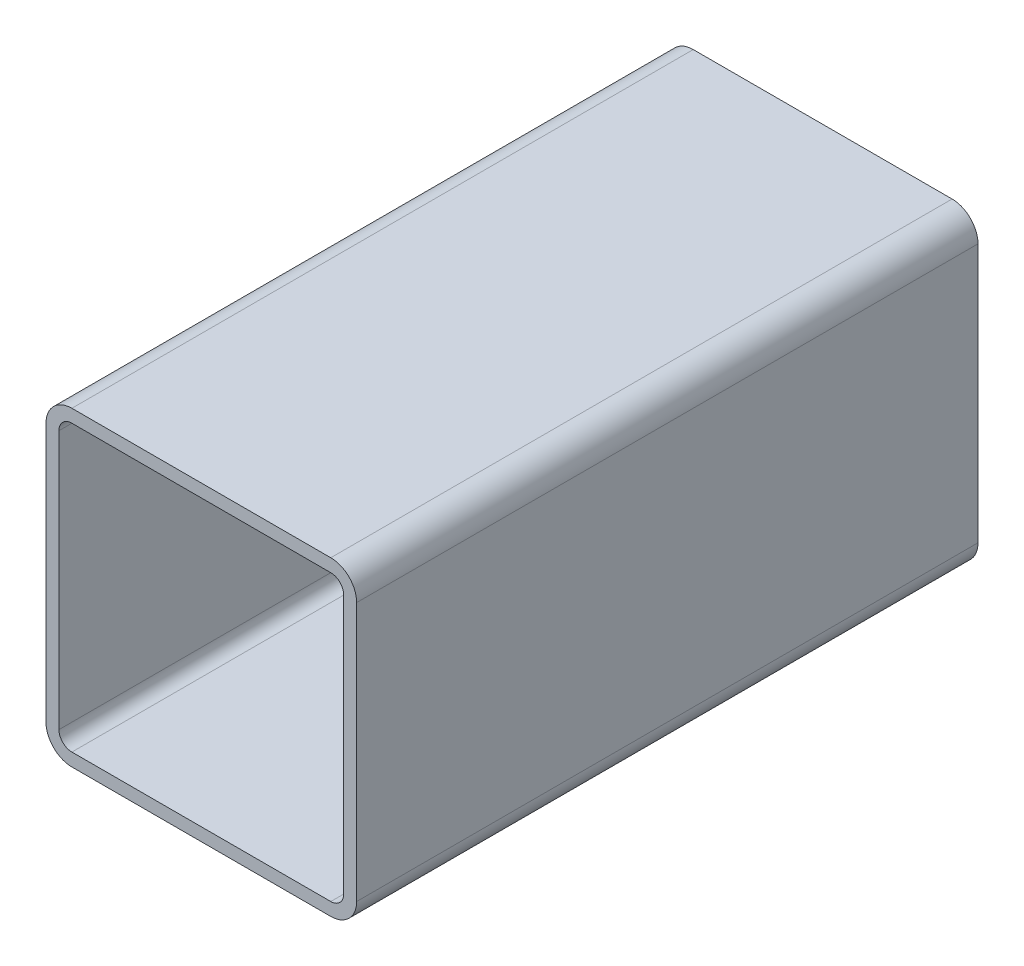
ISO-10303-21;
HEADER;
FILE_DESCRIPTION(('STEP AP214'),'2;1');
FILE_NAME('part.step','',(''),(''),'','','');
FILE_SCHEMA(('AUTOMOTIVE_DESIGN { 1 0 10303 214 1 1 1 1 }'));
ENDSEC;
DATA;
#1=APPLICATION_CONTEXT('core data for automotive mechanical design processes');
#2=APPLICATION_PROTOCOL_DEFINITION('international standard','automotive_design',2000,#1);
#3=PRODUCT_CONTEXT('',#1,'mechanical');
#4=PRODUCT('Part','Part','',(#3));
#5=PRODUCT_RELATED_PRODUCT_CATEGORY('part','',(#4));
#6=PRODUCT_DEFINITION_FORMATION('','',#4);
#7=PRODUCT_DEFINITION_CONTEXT('part definition',#1,'design');
#8=PRODUCT_DEFINITION('design','',#6,#7);
#9=PRODUCT_DEFINITION_SHAPE('','',#8);
#10=(LENGTH_UNIT() NAMED_UNIT(*) SI_UNIT(.MILLI.,.METRE.));
#11=(NAMED_UNIT(*) PLANE_ANGLE_UNIT() SI_UNIT($,.RADIAN.));
#12=(NAMED_UNIT(*) SI_UNIT($,.STERADIAN.) SOLID_ANGLE_UNIT());
#13=UNCERTAINTY_MEASURE_WITH_UNIT(LENGTH_MEASURE(1.E-05),#10,'distance_accuracy_value','');
#14=(GEOMETRIC_REPRESENTATION_CONTEXT(3) GLOBAL_UNCERTAINTY_ASSIGNED_CONTEXT((#13)) GLOBAL_UNIT_ASSIGNED_CONTEXT((#10,
#11,#12)) REPRESENTATION_CONTEXT('',''));
#15=CARTESIAN_POINT('',(0.,0.,0.));
#16=DIRECTION('',(0.,0.,1.));
#17=DIRECTION('',(1.,0.,0.));
#18=AXIS2_PLACEMENT_3D('',#15,#16,#17);
#19=CARTESIAN_POINT('',(12.7473013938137,141.711948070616,304.8));
#20=DIRECTION('',(0.,0.,1.));
#21=DIRECTION('',(1.,0.,0.));
#22=AXIS2_PLACEMENT_3D('',#19,#20,#21);
#23=PLANE('',#22);
#24=CARTESIAN_POINT('',(12.7473013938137,141.711948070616,304.8));
#25=DIRECTION('',(0.,0.,1.));
#26=DIRECTION('',(1.,0.,0.));
#27=AXIS2_PLACEMENT_3D('',#24,#25,#26);
#28=CIRCLE('',#27,12.7);
#29=CARTESIAN_POINT('',(12.7473013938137,154.411948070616,304.8));
#30=VERTEX_POINT('',#29);
#31=CARTESIAN_POINT('',(0.0473013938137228,141.711948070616,304.8));
#32=VERTEX_POINT('',#31);
#33=EDGE_CURVE('E211',#30,#32,#28,.T.);
#34=ORIENTED_EDGE('',*,*,#33,.T.);
#35=DIRECTION('',(0.,-1.,0.));
#36=VECTOR('',#35,1.);
#37=CARTESIAN_POINT('',(0.0473013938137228,14.7119480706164,304.8));
#38=LINE('',#37,#36);
#39=CARTESIAN_POINT('',(0.0473013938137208,14.7119480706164,304.8));
#40=VERTEX_POINT('',#39);
#41=EDGE_CURVE('E214',#32,#40,#38,.T.);
#42=ORIENTED_EDGE('',*,*,#41,.T.);
#43=CARTESIAN_POINT('',(12.7473013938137,14.7119480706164,304.8));
#44=DIRECTION('',(0.,0.,1.));
#45=DIRECTION('',(1.,0.,0.));
#46=AXIS2_PLACEMENT_3D('',#43,#44,#45);
#47=CIRCLE('',#46,12.7);
#48=CARTESIAN_POINT('',(12.7473013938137,2.01194807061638,304.8));
#49=VERTEX_POINT('',#48);
#50=EDGE_CURVE('E217',#40,#49,#47,.T.);
#51=ORIENTED_EDGE('',*,*,#50,.T.);
#52=DIRECTION('',(1.,0.,0.));
#53=VECTOR('',#52,1.);
#54=CARTESIAN_POINT('',(139.747301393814,2.01194807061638,304.8));
#55=LINE('',#54,#53);
#56=CARTESIAN_POINT('',(139.747301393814,2.01194807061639,304.8));
#57=VERTEX_POINT('',#56);
#58=EDGE_CURVE('E219',#49,#57,#55,.T.);
#59=ORIENTED_EDGE('',*,*,#58,.T.);
#60=CARTESIAN_POINT('',(139.747301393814,14.7119480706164,304.8));
#61=DIRECTION('',(0.,0.,1.));
#62=DIRECTION('',(1.,0.,0.));
#63=AXIS2_PLACEMENT_3D('',#60,#61,#62);
#64=CIRCLE('',#63,12.7);
#65=CARTESIAN_POINT('',(152.447301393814,14.7119480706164,304.8));
#66=VERTEX_POINT('',#65);
#67=EDGE_CURVE('E221',#57,#66,#64,.T.);
#68=ORIENTED_EDGE('',*,*,#67,.T.);
#69=DIRECTION('',(0.,1.,0.));
#70=VECTOR('',#69,1.);
#71=CARTESIAN_POINT('',(152.447301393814,141.711948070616,304.8));
#72=LINE('',#71,#70);
#73=CARTESIAN_POINT('',(152.447301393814,141.711948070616,304.8));
#74=VERTEX_POINT('',#73);
#75=EDGE_CURVE('E223',#66,#74,#72,.T.);
#76=ORIENTED_EDGE('',*,*,#75,.T.);
#77=CARTESIAN_POINT('',(139.747301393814,141.711948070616,304.8));
#78=DIRECTION('',(0.,0.,1.));
#79=DIRECTION('',(1.,0.,0.));
#80=AXIS2_PLACEMENT_3D('',#77,#78,#79);
#81=CIRCLE('',#80,12.7);
#82=CARTESIAN_POINT('',(139.747301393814,154.411948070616,304.8));
#83=VERTEX_POINT('',#82);
#84=EDGE_CURVE('E225',#74,#83,#81,.T.);
#85=ORIENTED_EDGE('',*,*,#84,.T.);
#86=DIRECTION('',(-1.,0.,0.));
#87=VECTOR('',#86,1.);
#88=CARTESIAN_POINT('',(12.7473013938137,154.411948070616,304.8));
#89=LINE('',#88,#87);
#90=EDGE_CURVE('E227',#83,#30,#89,.T.);
#91=ORIENTED_EDGE('',*,*,#90,.T.);
#92=EDGE_LOOP('',(#34,#42,#51,#59,#68,#76,#85,#91));
#93=FACE_BOUND('',#92,.T.);
#94=DIRECTION('',(0.,-1.,0.));
#95=VECTOR('',#94,1.);
#96=CARTESIAN_POINT('',(6.39730139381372,14.7119480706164,304.8));
#97=LINE('',#96,#95);
#98=CARTESIAN_POINT('',(6.39730139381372,141.711948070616,304.8));
#99=VERTEX_POINT('',#98);
#100=CARTESIAN_POINT('',(6.39730139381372,14.7119480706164,304.8));
#101=VERTEX_POINT('',#100);
#102=EDGE_CURVE('E154',#99,#101,#97,.T.);
#103=ORIENTED_EDGE('',*,*,#102,.F.);
#104=CARTESIAN_POINT('',(12.7473013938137,141.711948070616,304.8));
#105=DIRECTION('',(0.,0.,1.));
#106=DIRECTION('',(1.,0.,0.));
#107=AXIS2_PLACEMENT_3D('',#104,#105,#106);
#108=CIRCLE('',#107,6.35);
#109=CARTESIAN_POINT('',(12.7473013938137,148.061948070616,304.8));
#110=VERTEX_POINT('',#109);
#111=EDGE_CURVE('E146',#110,#99,#108,.T.);
#112=ORIENTED_EDGE('',*,*,#111,.F.);
#113=DIRECTION('',(-1.,0.,0.));
#114=VECTOR('',#113,1.);
#115=CARTESIAN_POINT('',(12.7473013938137,148.061948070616,304.8));
#116=LINE('',#115,#114);
#117=CARTESIAN_POINT('',(139.747301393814,148.061948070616,304.8));
#118=VERTEX_POINT('',#117);
#119=EDGE_CURVE('E179',#118,#110,#116,.T.);
#120=ORIENTED_EDGE('',*,*,#119,.F.);
#121=CARTESIAN_POINT('',(139.747301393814,141.711948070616,304.8));
#122=DIRECTION('',(0.,0.,1.));
#123=DIRECTION('',(1.,0.,0.));
#124=AXIS2_PLACEMENT_3D('',#121,#122,#123);
#125=CIRCLE('',#124,6.34999999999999);
#126=CARTESIAN_POINT('',(146.097301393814,141.711948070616,304.8));
#127=VERTEX_POINT('',#126);
#128=EDGE_CURVE('E177',#127,#118,#125,.T.);
#129=ORIENTED_EDGE('',*,*,#128,.F.);
#130=DIRECTION('',(0.,1.,0.));
#131=VECTOR('',#130,1.);
#132=CARTESIAN_POINT('',(146.097301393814,141.711948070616,304.8));
#133=LINE('',#132,#131);
#134=CARTESIAN_POINT('',(146.097301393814,14.7119480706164,304.8));
#135=VERTEX_POINT('',#134);
#136=EDGE_CURVE('E175',#135,#127,#133,.T.);
#137=ORIENTED_EDGE('',*,*,#136,.F.);
#138=CARTESIAN_POINT('',(139.747301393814,14.7119480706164,304.8));
#139=DIRECTION('',(0.,0.,1.));
#140=DIRECTION('',(1.,0.,0.));
#141=AXIS2_PLACEMENT_3D('',#138,#139,#140);
#142=CIRCLE('',#141,6.35);
#143=CARTESIAN_POINT('',(139.747301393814,8.36194807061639,304.8));
#144=VERTEX_POINT('',#143);
#145=EDGE_CURVE('E173',#144,#135,#142,.T.);
#146=ORIENTED_EDGE('',*,*,#145,.F.);
#147=DIRECTION('',(1.,0.,0.));
#148=VECTOR('',#147,1.);
#149=CARTESIAN_POINT('',(139.747301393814,8.36194807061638,304.8));
#150=LINE('',#149,#148);
#151=CARTESIAN_POINT('',(12.7473013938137,8.36194807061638,304.8));
#152=VERTEX_POINT('',#151);
#153=EDGE_CURVE('E169',#152,#144,#150,.T.);
#154=ORIENTED_EDGE('',*,*,#153,.F.);
#155=CARTESIAN_POINT('',(12.7473013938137,14.7119480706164,304.8));
#156=DIRECTION('',(0.,0.,1.));
#157=DIRECTION('',(1.,0.,0.));
#158=AXIS2_PLACEMENT_3D('',#155,#156,#157);
#159=CIRCLE('',#158,6.35);
#160=EDGE_CURVE('E167',#101,#152,#159,.T.);
#161=ORIENTED_EDGE('',*,*,#160,.F.);
#162=EDGE_LOOP('',(#103,#112,#120,#129,#137,#146,#154,#161));
#163=FACE_BOUND('',#162,.T.);
#164=ADVANCED_FACE('F33',(#93,#163),#23,.T.);
#165=CARTESIAN_POINT('',(12.7473013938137,141.711948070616,0.));
#166=DIRECTION('',(0.,0.,1.));
#167=DIRECTION('',(1.,0.,0.));
#168=AXIS2_PLACEMENT_3D('',#165,#166,#167);
#169=PLANE('',#168);
#170=CARTESIAN_POINT('',(12.7473013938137,141.711948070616,0.));
#171=DIRECTION('',(0.,0.,1.));
#172=DIRECTION('',(1.,0.,0.));
#173=AXIS2_PLACEMENT_3D('',#170,#171,#172);
#174=CIRCLE('',#173,12.7);
#175=CARTESIAN_POINT('',(12.7473013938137,154.411948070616,0.));
#176=VERTEX_POINT('',#175);
#177=CARTESIAN_POINT('',(0.0473013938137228,141.711948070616,0.));
#178=VERTEX_POINT('',#177);
#179=EDGE_CURVE('E162',#176,#178,#174,.T.);
#180=ORIENTED_EDGE('',*,*,#179,.F.);
#181=DIRECTION('',(-1.,0.,0.));
#182=VECTOR('',#181,1.);
#183=CARTESIAN_POINT('',(12.7473013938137,154.411948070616,0.));
#184=LINE('',#183,#182);
#185=CARTESIAN_POINT('',(139.747301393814,154.411948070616,0.));
#186=VERTEX_POINT('',#185);
#187=EDGE_CURVE('E215',#186,#176,#184,.T.);
#188=ORIENTED_EDGE('',*,*,#187,.F.);
#189=CARTESIAN_POINT('',(139.747301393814,141.711948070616,0.));
#190=DIRECTION('',(0.,0.,1.));
#191=DIRECTION('',(1.,0.,0.));
#192=AXIS2_PLACEMENT_3D('',#189,#190,#191);
#193=CIRCLE('',#192,12.7);
#194=CARTESIAN_POINT('',(152.447301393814,141.711948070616,0.));
#195=VERTEX_POINT('',#194);
#196=EDGE_CURVE('E242',#195,#186,#193,.T.);
#197=ORIENTED_EDGE('',*,*,#196,.F.);
#198=DIRECTION('',(0.,1.,0.));
#199=VECTOR('',#198,1.);
#200=CARTESIAN_POINT('',(152.447301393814,141.711948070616,0.));
#201=LINE('',#200,#199);
#202=CARTESIAN_POINT('',(152.447301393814,14.7119480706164,0.));
#203=VERTEX_POINT('',#202);
#204=EDGE_CURVE('E240',#203,#195,#201,.T.);
#205=ORIENTED_EDGE('',*,*,#204,.F.);
#206=CARTESIAN_POINT('',(139.747301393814,14.7119480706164,0.));
#207=DIRECTION('',(0.,0.,1.));
#208=DIRECTION('',(1.,0.,0.));
#209=AXIS2_PLACEMENT_3D('',#206,#207,#208);
#210=CIRCLE('',#209,12.7);
#211=CARTESIAN_POINT('',(139.747301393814,2.01194807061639,0.));
#212=VERTEX_POINT('',#211);
#213=EDGE_CURVE('E238',#212,#203,#210,.T.);
#214=ORIENTED_EDGE('',*,*,#213,.F.);
#215=DIRECTION('',(1.,0.,0.));
#216=VECTOR('',#215,1.);
#217=CARTESIAN_POINT('',(139.747301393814,2.01194807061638,0.));
#218=LINE('',#217,#216);
#219=CARTESIAN_POINT('',(12.7473013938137,2.01194807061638,0.));
#220=VERTEX_POINT('',#219);
#221=EDGE_CURVE('E236',#220,#212,#218,.T.);
#222=ORIENTED_EDGE('',*,*,#221,.F.);
#223=CARTESIAN_POINT('',(12.7473013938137,14.7119480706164,0.));
#224=DIRECTION('',(0.,0.,1.));
#225=DIRECTION('',(1.,0.,0.));
#226=AXIS2_PLACEMENT_3D('',#223,#224,#225);
#227=CIRCLE('',#226,12.7);
#228=CARTESIAN_POINT('',(0.0473013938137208,14.7119480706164,0.));
#229=VERTEX_POINT('',#228);
#230=EDGE_CURVE('E234',#229,#220,#227,.T.);
#231=ORIENTED_EDGE('',*,*,#230,.F.);
#232=DIRECTION('',(0.,-1.,0.));
#233=VECTOR('',#232,1.);
#234=CARTESIAN_POINT('',(0.0473013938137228,14.7119480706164,0.));
#235=LINE('',#234,#233);
#236=EDGE_CURVE('E232',#178,#229,#235,.T.);
#237=ORIENTED_EDGE('',*,*,#236,.F.);
#238=EDGE_LOOP('',(#180,#188,#197,#205,#214,#222,#231,#237));
#239=FACE_BOUND('',#238,.T.);
#240=CARTESIAN_POINT('',(12.7473013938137,141.711948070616,0.));
#241=DIRECTION('',(0.,0.,1.));
#242=DIRECTION('',(1.,0.,0.));
#243=AXIS2_PLACEMENT_3D('',#240,#241,#242);
#244=CIRCLE('',#243,6.35);
#245=CARTESIAN_POINT('',(12.7473013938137,148.061948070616,0.));
#246=VERTEX_POINT('',#245);
#247=CARTESIAN_POINT('',(6.39730139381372,141.711948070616,0.));
#248=VERTEX_POINT('',#247);
#249=EDGE_CURVE('E56',#246,#248,#244,.T.);
#250=ORIENTED_EDGE('',*,*,#249,.T.);
#251=DIRECTION('',(0.,-1.,0.));
#252=VECTOR('',#251,1.);
#253=CARTESIAN_POINT('',(6.39730139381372,14.7119480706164,0.));
#254=LINE('',#253,#252);
#255=CARTESIAN_POINT('',(6.39730139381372,14.7119480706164,0.));
#256=VERTEX_POINT('',#255);
#257=EDGE_CURVE('E161',#248,#256,#254,.T.);
#258=ORIENTED_EDGE('',*,*,#257,.T.);
#259=CARTESIAN_POINT('',(12.7473013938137,14.7119480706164,0.));
#260=DIRECTION('',(0.,0.,1.));
#261=DIRECTION('',(1.,0.,0.));
#262=AXIS2_PLACEMENT_3D('',#259,#260,#261);
#263=CIRCLE('',#262,6.35);
#264=CARTESIAN_POINT('',(12.7473013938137,8.36194807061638,0.));
#265=VERTEX_POINT('',#264);
#266=EDGE_CURVE('E183',#256,#265,#263,.T.);
#267=ORIENTED_EDGE('',*,*,#266,.T.);
#268=DIRECTION('',(1.,0.,0.));
#269=VECTOR('',#268,1.);
#270=CARTESIAN_POINT('',(139.747301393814,8.36194807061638,0.));
#271=LINE('',#270,#269);
#272=CARTESIAN_POINT('',(139.747301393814,8.36194807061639,0.));
#273=VERTEX_POINT('',#272);
#274=EDGE_CURVE('E186',#265,#273,#271,.T.);
#275=ORIENTED_EDGE('',*,*,#274,.T.);
#276=CARTESIAN_POINT('',(139.747301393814,14.7119480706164,0.));
#277=DIRECTION('',(0.,0.,1.));
#278=DIRECTION('',(1.,0.,0.));
#279=AXIS2_PLACEMENT_3D('',#276,#277,#278);
#280=CIRCLE('',#279,6.35);
#281=CARTESIAN_POINT('',(146.097301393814,14.7119480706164,0.));
#282=VERTEX_POINT('',#281);
#283=EDGE_CURVE('E189',#273,#282,#280,.T.);
#284=ORIENTED_EDGE('',*,*,#283,.T.);
#285=DIRECTION('',(0.,1.,0.));
#286=VECTOR('',#285,1.);
#287=CARTESIAN_POINT('',(146.097301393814,141.711948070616,0.));
#288=LINE('',#287,#286);
#289=CARTESIAN_POINT('',(146.097301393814,141.711948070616,0.));
#290=VERTEX_POINT('',#289);
#291=EDGE_CURVE('E192',#282,#290,#288,.T.);
#292=ORIENTED_EDGE('',*,*,#291,.T.);
#293=CARTESIAN_POINT('',(139.747301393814,141.711948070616,0.));
#294=DIRECTION('',(0.,0.,1.));
#295=DIRECTION('',(1.,0.,0.));
#296=AXIS2_PLACEMENT_3D('',#293,#294,#295);
#297=CIRCLE('',#296,6.34999999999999);
#298=CARTESIAN_POINT('',(139.747301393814,148.061948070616,0.));
#299=VERTEX_POINT('',#298);
#300=EDGE_CURVE('E195',#290,#299,#297,.T.);
#301=ORIENTED_EDGE('',*,*,#300,.T.);
#302=DIRECTION('',(-1.,0.,0.));
#303=VECTOR('',#302,1.);
#304=CARTESIAN_POINT('',(12.7473013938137,148.061948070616,0.));
#305=LINE('',#304,#303);
#306=EDGE_CURVE('E155',#299,#246,#305,.T.);
#307=ORIENTED_EDGE('',*,*,#306,.T.);
#308=EDGE_LOOP('',(#250,#258,#267,#275,#284,#292,#301,#307));
#309=FACE_BOUND('',#308,.T.);
#310=ADVANCED_FACE('F272',(#239,#309),#169,.F.);
#311=CARTESIAN_POINT('',(12.7473013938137,141.711948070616,304.8));
#312=DIRECTION('',(0.,0.,-1.));
#313=DIRECTION('',(-1.,0.,0.));
#314=AXIS2_PLACEMENT_3D('',#311,#312,#313);
#315=CYLINDRICAL_SURFACE('',#314,12.7);
#316=ORIENTED_EDGE('',*,*,#179,.T.);
#317=DIRECTION('',(0.,0.,-1.));
#318=VECTOR('',#317,1.);
#319=CARTESIAN_POINT('',(0.0473013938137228,141.711948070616,304.8));
#320=LINE('',#319,#318);
#321=EDGE_CURVE('E11',#32,#178,#320,.T.);
#322=ORIENTED_EDGE('',*,*,#321,.F.);
#323=ORIENTED_EDGE('',*,*,#33,.F.);
#324=DIRECTION('',(0.,0.,-1.));
#325=VECTOR('',#324,1.);
#326=CARTESIAN_POINT('',(12.7473013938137,154.411948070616,304.8));
#327=LINE('',#326,#325);
#328=EDGE_CURVE('E229',#30,#176,#327,.T.);
#329=ORIENTED_EDGE('',*,*,#328,.T.);
#330=EDGE_LOOP('',(#316,#322,#323,#329));
#331=FACE_BOUND('',#330,.T.);
#332=ADVANCED_FACE('F35',(#331),#315,.T.);
#333=CARTESIAN_POINT('',(0.0473013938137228,14.7119480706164,304.8));
#334=DIRECTION('',(1.,0.,0.));
#335=DIRECTION('',(0.,0.,-1.));
#336=AXIS2_PLACEMENT_3D('',#333,#334,#335);
#337=PLANE('',#336);
#338=ORIENTED_EDGE('',*,*,#236,.T.);
#339=DIRECTION('',(0.,0.,-1.));
#340=VECTOR('',#339,1.);
#341=CARTESIAN_POINT('',(0.0473013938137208,14.7119480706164,304.8));
#342=LINE('',#341,#340);
#343=EDGE_CURVE('E41',#40,#229,#342,.T.);
#344=ORIENTED_EDGE('',*,*,#343,.F.);
#345=ORIENTED_EDGE('',*,*,#41,.F.);
#346=ORIENTED_EDGE('',*,*,#321,.T.);
#347=EDGE_LOOP('',(#338,#344,#345,#346));
#348=FACE_BOUND('',#347,.T.);
#349=ADVANCED_FACE('F289',(#348),#337,.F.);
#350=CARTESIAN_POINT('',(12.7473013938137,14.7119480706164,304.8));
#351=DIRECTION('',(0.,0.,-1.));
#352=DIRECTION('',(-1.,0.,0.));
#353=AXIS2_PLACEMENT_3D('',#350,#351,#352);
#354=CYLINDRICAL_SURFACE('',#353,12.7);
#355=ORIENTED_EDGE('',*,*,#230,.T.);
#356=DIRECTION('',(0.,0.,-1.));
#357=VECTOR('',#356,1.);
#358=CARTESIAN_POINT('',(12.7473013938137,2.01194807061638,304.8));
#359=LINE('',#358,#357);
#360=EDGE_CURVE('E259',#49,#220,#359,.T.);
#361=ORIENTED_EDGE('',*,*,#360,.F.);
#362=ORIENTED_EDGE('',*,*,#50,.F.);
#363=ORIENTED_EDGE('',*,*,#343,.T.);
#364=EDGE_LOOP('',(#355,#361,#362,#363));
#365=FACE_BOUND('',#364,.T.);
#366=ADVANCED_FACE('F266',(#365),#354,.T.);
#367=CARTESIAN_POINT('',(139.747301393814,2.01194807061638,304.8));
#368=DIRECTION('',(0.,1.,0.));
#369=DIRECTION('',(0.,0.,1.));
#370=AXIS2_PLACEMENT_3D('',#367,#368,#369);
#371=PLANE('',#370);
#372=ORIENTED_EDGE('',*,*,#221,.T.);
#373=DIRECTION('',(0.,0.,-1.));
#374=VECTOR('',#373,1.);
#375=CARTESIAN_POINT('',(139.747301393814,2.01194807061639,304.8));
#376=LINE('',#375,#374);
#377=EDGE_CURVE('E256',#57,#212,#376,.T.);
#378=ORIENTED_EDGE('',*,*,#377,.F.);
#379=ORIENTED_EDGE('',*,*,#58,.F.);
#380=ORIENTED_EDGE('',*,*,#360,.T.);
#381=EDGE_LOOP('',(#372,#378,#379,#380));
#382=FACE_BOUND('',#381,.T.);
#383=ADVANCED_FACE('F278',(#382),#371,.F.);
#384=CARTESIAN_POINT('',(139.747301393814,14.7119480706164,304.8));
#385=DIRECTION('',(0.,0.,-1.));
#386=DIRECTION('',(-1.,0.,0.));
#387=AXIS2_PLACEMENT_3D('',#384,#385,#386);
#388=CYLINDRICAL_SURFACE('',#387,12.7);
#389=ORIENTED_EDGE('',*,*,#213,.T.);
#390=DIRECTION('',(0.,0.,-1.));
#391=VECTOR('',#390,1.);
#392=CARTESIAN_POINT('',(152.447301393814,14.7119480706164,304.8));
#393=LINE('',#392,#391);
#394=EDGE_CURVE('E253',#66,#203,#393,.T.);
#395=ORIENTED_EDGE('',*,*,#394,.F.);
#396=ORIENTED_EDGE('',*,*,#67,.F.);
#397=ORIENTED_EDGE('',*,*,#377,.T.);
#398=EDGE_LOOP('',(#389,#395,#396,#397));
#399=FACE_BOUND('',#398,.T.);
#400=ADVANCED_FACE('F282',(#399),#388,.T.);
#401=CARTESIAN_POINT('',(152.447301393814,141.711948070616,304.8));
#402=DIRECTION('',(-1.,0.,0.));
#403=DIRECTION('',(0.,0.,1.));
#404=AXIS2_PLACEMENT_3D('',#401,#402,#403);
#405=PLANE('',#404);
#406=ORIENTED_EDGE('',*,*,#204,.T.);
#407=DIRECTION('',(0.,0.,-1.));
#408=VECTOR('',#407,1.);
#409=CARTESIAN_POINT('',(152.447301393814,141.711948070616,304.8));
#410=LINE('',#409,#408);
#411=EDGE_CURVE('E250',#74,#195,#410,.T.);
#412=ORIENTED_EDGE('',*,*,#411,.F.);
#413=ORIENTED_EDGE('',*,*,#75,.F.);
#414=ORIENTED_EDGE('',*,*,#394,.T.);
#415=EDGE_LOOP('',(#406,#412,#413,#414));
#416=FACE_BOUND('',#415,.T.);
#417=ADVANCED_FACE('F302',(#416),#405,.F.);
#418=CARTESIAN_POINT('',(139.747301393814,141.711948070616,304.8));
#419=DIRECTION('',(0.,0.,-1.));
#420=DIRECTION('',(-1.,0.,0.));
#421=AXIS2_PLACEMENT_3D('',#418,#419,#420);
#422=CYLINDRICAL_SURFACE('',#421,12.7);
#423=ORIENTED_EDGE('',*,*,#196,.T.);
#424=DIRECTION('',(0.,0.,-1.));
#425=VECTOR('',#424,1.);
#426=CARTESIAN_POINT('',(139.747301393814,154.411948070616,304.8));
#427=LINE('',#426,#425);
#428=EDGE_CURVE('E247',#83,#186,#427,.T.);
#429=ORIENTED_EDGE('',*,*,#428,.F.);
#430=ORIENTED_EDGE('',*,*,#84,.F.);
#431=ORIENTED_EDGE('',*,*,#411,.T.);
#432=EDGE_LOOP('',(#423,#429,#430,#431));
#433=FACE_BOUND('',#432,.T.);
#434=ADVANCED_FACE('F300',(#433),#422,.T.);
#435=CARTESIAN_POINT('',(12.7473013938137,154.411948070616,304.8));
#436=DIRECTION('',(0.,-1.,0.));
#437=DIRECTION('',(0.,0.,-1.));
#438=AXIS2_PLACEMENT_3D('',#435,#436,#437);
#439=PLANE('',#438);
#440=ORIENTED_EDGE('',*,*,#187,.T.);
#441=ORIENTED_EDGE('',*,*,#328,.F.);
#442=ORIENTED_EDGE('',*,*,#90,.F.);
#443=ORIENTED_EDGE('',*,*,#428,.T.);
#444=EDGE_LOOP('',(#440,#441,#442,#443));
#445=FACE_BOUND('',#444,.T.);
#446=ADVANCED_FACE('F295',(#445),#439,.F.);
#447=CARTESIAN_POINT('',(12.7473013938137,141.711948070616,304.8));
#448=DIRECTION('',(0.,0.,-1.));
#449=DIRECTION('',(-1.,0.,0.));
#450=AXIS2_PLACEMENT_3D('',#447,#448,#449);
#451=CYLINDRICAL_SURFACE('',#450,6.35);
#452=ORIENTED_EDGE('',*,*,#249,.F.);
#453=DIRECTION('',(0.,0.,-1.));
#454=VECTOR('',#453,1.);
#455=CARTESIAN_POINT('',(12.7473013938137,148.061948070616,304.8));
#456=LINE('',#455,#454);
#457=EDGE_CURVE('E150',#110,#246,#456,.T.);
#458=ORIENTED_EDGE('',*,*,#457,.F.);
#459=ORIENTED_EDGE('',*,*,#111,.T.);
#460=DIRECTION('',(0.,0.,-1.));
#461=VECTOR('',#460,1.);
#462=CARTESIAN_POINT('',(6.39730139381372,141.711948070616,304.8));
#463=LINE('',#462,#461);
#464=EDGE_CURVE('E149',#99,#248,#463,.T.);
#465=ORIENTED_EDGE('',*,*,#464,.T.);
#466=EDGE_LOOP('',(#452,#458,#459,#465));
#467=FACE_BOUND('',#466,.T.);
#468=ADVANCED_FACE('F148',(#467),#451,.F.);
#469=CARTESIAN_POINT('',(6.39730139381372,14.7119480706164,304.8));
#470=DIRECTION('',(1.,0.,0.));
#471=DIRECTION('',(0.,0.,-1.));
#472=AXIS2_PLACEMENT_3D('',#469,#470,#471);
#473=PLANE('',#472);
#474=ORIENTED_EDGE('',*,*,#257,.F.);
#475=ORIENTED_EDGE('',*,*,#464,.F.);
#476=ORIENTED_EDGE('',*,*,#102,.T.);
#477=DIRECTION('',(0.,0.,-1.));
#478=VECTOR('',#477,1.);
#479=CARTESIAN_POINT('',(6.39730139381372,14.7119480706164,304.8));
#480=LINE('',#479,#478);
#481=EDGE_CURVE('E163',#101,#256,#480,.T.);
#482=ORIENTED_EDGE('',*,*,#481,.T.);
#483=EDGE_LOOP('',(#474,#475,#476,#482));
#484=FACE_BOUND('',#483,.T.);
#485=ADVANCED_FACE('F158',(#484),#473,.T.);
#486=CARTESIAN_POINT('',(12.7473013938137,14.7119480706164,304.8));
#487=DIRECTION('',(0.,0.,-1.));
#488=DIRECTION('',(-1.,0.,0.));
#489=AXIS2_PLACEMENT_3D('',#486,#487,#488);
#490=CYLINDRICAL_SURFACE('',#489,6.35);
#491=ORIENTED_EDGE('',*,*,#266,.F.);
#492=ORIENTED_EDGE('',*,*,#481,.F.);
#493=ORIENTED_EDGE('',*,*,#160,.T.);
#494=DIRECTION('',(0.,0.,-1.));
#495=VECTOR('',#494,1.);
#496=CARTESIAN_POINT('',(12.7473013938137,8.36194807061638,304.8));
#497=LINE('',#496,#495);
#498=EDGE_CURVE('E208',#152,#265,#497,.T.);
#499=ORIENTED_EDGE('',*,*,#498,.T.);
#500=EDGE_LOOP('',(#491,#492,#493,#499));
#501=FACE_BOUND('',#500,.T.);
#502=ADVANCED_FACE('F327',(#501),#490,.F.);
#503=CARTESIAN_POINT('',(139.747301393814,8.36194807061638,304.8));
#504=DIRECTION('',(0.,1.,0.));
#505=DIRECTION('',(0.,0.,1.));
#506=AXIS2_PLACEMENT_3D('',#503,#504,#505);
#507=PLANE('',#506);
#508=ORIENTED_EDGE('',*,*,#274,.F.);
#509=ORIENTED_EDGE('',*,*,#498,.F.);
#510=ORIENTED_EDGE('',*,*,#153,.T.);
#511=DIRECTION('',(0.,0.,-1.));
#512=VECTOR('',#511,1.);
#513=CARTESIAN_POINT('',(139.747301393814,8.36194807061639,304.8));
#514=LINE('',#513,#512);
#515=EDGE_CURVE('E206',#144,#273,#514,.T.);
#516=ORIENTED_EDGE('',*,*,#515,.T.);
#517=EDGE_LOOP('',(#508,#509,#510,#516));
#518=FACE_BOUND('',#517,.T.);
#519=ADVANCED_FACE('F331',(#518),#507,.T.);
#520=CARTESIAN_POINT('',(139.747301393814,14.7119480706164,304.8));
#521=DIRECTION('',(0.,0.,-1.));
#522=DIRECTION('',(-1.,0.,0.));
#523=AXIS2_PLACEMENT_3D('',#520,#521,#522);
#524=CYLINDRICAL_SURFACE('',#523,6.35);
#525=ORIENTED_EDGE('',*,*,#283,.F.);
#526=ORIENTED_EDGE('',*,*,#515,.F.);
#527=ORIENTED_EDGE('',*,*,#145,.T.);
#528=DIRECTION('',(0.,0.,-1.));
#529=VECTOR('',#528,1.);
#530=CARTESIAN_POINT('',(146.097301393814,14.7119480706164,304.8));
#531=LINE('',#530,#529);
#532=EDGE_CURVE('E204',#135,#282,#531,.T.);
#533=ORIENTED_EDGE('',*,*,#532,.T.);
#534=EDGE_LOOP('',(#525,#526,#527,#533));
#535=FACE_BOUND('',#534,.T.);
#536=ADVANCED_FACE('F337',(#535),#524,.F.);
#537=CARTESIAN_POINT('',(146.097301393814,141.711948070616,304.8));
#538=DIRECTION('',(-1.,0.,0.));
#539=DIRECTION('',(0.,0.,1.));
#540=AXIS2_PLACEMENT_3D('',#537,#538,#539);
#541=PLANE('',#540);
#542=ORIENTED_EDGE('',*,*,#291,.F.);
#543=ORIENTED_EDGE('',*,*,#532,.F.);
#544=ORIENTED_EDGE('',*,*,#136,.T.);
#545=DIRECTION('',(0.,0.,-1.));
#546=VECTOR('',#545,1.);
#547=CARTESIAN_POINT('',(146.097301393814,141.711948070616,304.8));
#548=LINE('',#547,#546);
#549=EDGE_CURVE('E202',#127,#290,#548,.T.);
#550=ORIENTED_EDGE('',*,*,#549,.T.);
#551=EDGE_LOOP('',(#542,#543,#544,#550));
#552=FACE_BOUND('',#551,.T.);
#553=ADVANCED_FACE('F341',(#552),#541,.T.);
#554=CARTESIAN_POINT('',(139.747301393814,141.711948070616,304.8));
#555=DIRECTION('',(0.,0.,-1.));
#556=DIRECTION('',(-1.,0.,0.));
#557=AXIS2_PLACEMENT_3D('',#554,#555,#556);
#558=CYLINDRICAL_SURFACE('',#557,6.34999999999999);
#559=ORIENTED_EDGE('',*,*,#300,.F.);
#560=ORIENTED_EDGE('',*,*,#549,.F.);
#561=ORIENTED_EDGE('',*,*,#128,.T.);
#562=DIRECTION('',(0.,0.,-1.));
#563=VECTOR('',#562,1.);
#564=CARTESIAN_POINT('',(139.747301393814,148.061948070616,304.8));
#565=LINE('',#564,#563);
#566=EDGE_CURVE('E48',#118,#299,#565,.T.);
#567=ORIENTED_EDGE('',*,*,#566,.T.);
#568=EDGE_LOOP('',(#559,#560,#561,#567));
#569=FACE_BOUND('',#568,.T.);
#570=ADVANCED_FACE('F345',(#569),#558,.F.);
#571=CARTESIAN_POINT('',(12.7473013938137,148.061948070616,304.8));
#572=DIRECTION('',(0.,-1.,0.));
#573=DIRECTION('',(0.,0.,-1.));
#574=AXIS2_PLACEMENT_3D('',#571,#572,#573);
#575=PLANE('',#574);
#576=ORIENTED_EDGE('',*,*,#306,.F.);
#577=ORIENTED_EDGE('',*,*,#566,.F.);
#578=ORIENTED_EDGE('',*,*,#119,.T.);
#579=ORIENTED_EDGE('',*,*,#457,.T.);
#580=EDGE_LOOP('',(#576,#577,#578,#579));
#581=FACE_BOUND('',#580,.T.);
#582=ADVANCED_FACE('F349',(#581),#575,.T.);
#583=CLOSED_SHELL('',(#164,#310,#332,#349,#366,#383,#400,#417,#434,#446,#468,#485,#502,#519,
#536,#553,#570,#582));
#584=MANIFOLD_SOLID_BREP('B2',#583);
#585=ADVANCED_BREP_SHAPE_REPRESENTATION('',(#18,#584),#14);
#586=SHAPE_DEFINITION_REPRESENTATION(#9,#585);
ENDSEC;
END-ISO-10303-21;
